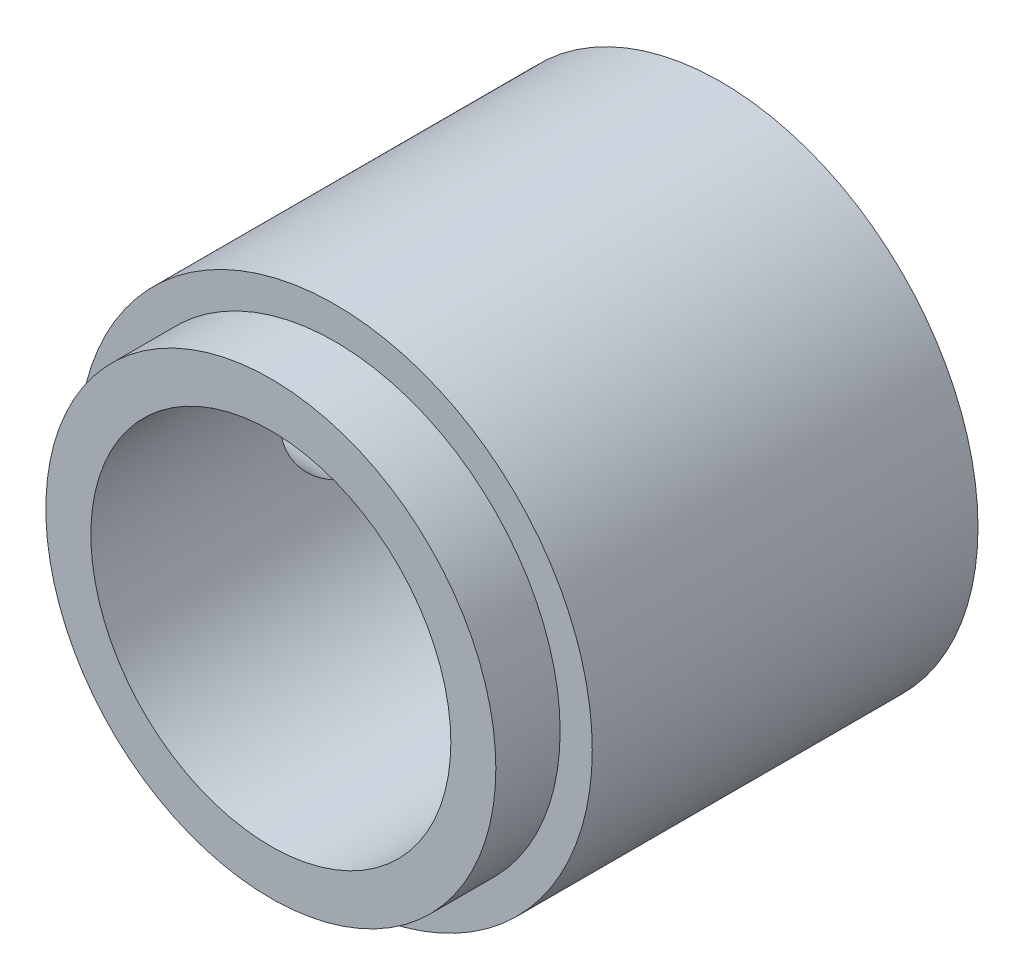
ISO-10303-21;
HEADER;
FILE_DESCRIPTION(('STEP AP214'),'2;1');
FILE_NAME('part.step','',(''),(''),'','','');
FILE_SCHEMA(('AUTOMOTIVE_DESIGN { 1 0 10303 214 1 1 1 1 }'));
ENDSEC;
DATA;
#1=APPLICATION_CONTEXT('core data for automotive mechanical design processes');
#2=APPLICATION_PROTOCOL_DEFINITION('international standard','automotive_design',2000,#1);
#3=PRODUCT_CONTEXT('',#1,'mechanical');
#4=PRODUCT('Part','Part','',(#3));
#5=PRODUCT_RELATED_PRODUCT_CATEGORY('part','',(#4));
#6=PRODUCT_DEFINITION_FORMATION('','',#4);
#7=PRODUCT_DEFINITION_CONTEXT('part definition',#1,'design');
#8=PRODUCT_DEFINITION('design','',#6,#7);
#9=PRODUCT_DEFINITION_SHAPE('','',#8);
#10=(LENGTH_UNIT() NAMED_UNIT(*) SI_UNIT(.MILLI.,.METRE.));
#11=(NAMED_UNIT(*) PLANE_ANGLE_UNIT() SI_UNIT($,.RADIAN.));
#12=(NAMED_UNIT(*) SI_UNIT($,.STERADIAN.) SOLID_ANGLE_UNIT());
#13=UNCERTAINTY_MEASURE_WITH_UNIT(LENGTH_MEASURE(1.E-05),#10,'distance_accuracy_value','');
#14=(GEOMETRIC_REPRESENTATION_CONTEXT(3) GLOBAL_UNCERTAINTY_ASSIGNED_CONTEXT((#13)) GLOBAL_UNIT_ASSIGNED_CONTEXT((#10,
#11,#12)) REPRESENTATION_CONTEXT('',''));
#15=CARTESIAN_POINT('',(0.,0.,0.));
#16=DIRECTION('',(0.,0.,1.));
#17=DIRECTION('',(1.,0.,0.));
#18=AXIS2_PLACEMENT_3D('',#15,#16,#17);
#19=CARTESIAN_POINT('',(0.,0.,30.));
#20=DIRECTION('',(0.,0.,1.));
#21=DIRECTION('',(1.,0.,0.));
#22=AXIS2_PLACEMENT_3D('',#19,#20,#21);
#23=PLANE('',#22);
#24=CARTESIAN_POINT('',(0.,0.,30.));
#25=DIRECTION('',(0.,0.,1.));
#26=DIRECTION('',(1.,0.,0.));
#27=AXIS2_PLACEMENT_3D('',#24,#25,#26);
#28=CIRCLE('',#27,20.);
#29=CARTESIAN_POINT('',(20.,0.,30.));
#30=VERTEX_POINT('',#29);
#31=EDGE_CURVE('E10',#30,#30,#28,.T.);
#32=ORIENTED_EDGE('',*,*,#31,.T.);
#33=EDGE_LOOP('',(#32));
#34=FACE_BOUND('',#33,.T.);
#35=CARTESIAN_POINT('',(0.,0.,30.));
#36=DIRECTION('',(0.,0.,1.));
#37=DIRECTION('',(1.,0.,0.));
#38=AXIS2_PLACEMENT_3D('',#35,#36,#37);
#39=CIRCLE('',#38,17.5);
#40=CARTESIAN_POINT('',(17.5,0.,30.));
#41=VERTEX_POINT('',#40);
#42=EDGE_CURVE('E52',#41,#41,#39,.T.);
#43=ORIENTED_EDGE('',*,*,#42,.F.);
#44=EDGE_LOOP('',(#43));
#45=FACE_BOUND('',#44,.T.);
#46=ADVANCED_FACE('F27',(#34,#45),#23,.T.);
#47=CARTESIAN_POINT('',(0.,0.,0.));
#48=DIRECTION('',(0.,0.,1.));
#49=DIRECTION('',(1.,0.,0.));
#50=AXIS2_PLACEMENT_3D('',#47,#48,#49);
#51=PLANE('',#50);
#52=CARTESIAN_POINT('',(0.,0.,0.));
#53=DIRECTION('',(0.,0.,1.));
#54=DIRECTION('',(1.,0.,0.));
#55=AXIS2_PLACEMENT_3D('',#52,#53,#54);
#56=CIRCLE('',#55,20.);
#57=CARTESIAN_POINT('',(20.,0.,0.));
#58=VERTEX_POINT('',#57);
#59=EDGE_CURVE('E40',#58,#58,#56,.T.);
#60=ORIENTED_EDGE('',*,*,#59,.F.);
#61=EDGE_LOOP('',(#60));
#62=FACE_BOUND('',#61,.T.);
#63=CARTESIAN_POINT('',(0.,0.,0.));
#64=DIRECTION('',(0.,0.,1.));
#65=DIRECTION('',(1.,0.,0.));
#66=AXIS2_PLACEMENT_3D('',#63,#64,#65);
#67=CIRCLE('',#66,14.);
#68=CARTESIAN_POINT('',(14.,0.,0.));
#69=VERTEX_POINT('',#68);
#70=EDGE_CURVE('E44',#69,#69,#67,.T.);
#71=ORIENTED_EDGE('',*,*,#70,.T.);
#72=EDGE_LOOP('',(#71));
#73=FACE_BOUND('',#72,.T.);
#74=ADVANCED_FACE('F80',(#62,#73),#51,.F.);
#75=CARTESIAN_POINT('',(0.,0.,30.));
#76=DIRECTION('',(0.,0.,-1.));
#77=DIRECTION('',(-1.,0.,0.));
#78=AXIS2_PLACEMENT_3D('',#75,#76,#77);
#79=CYLINDRICAL_SURFACE('',#78,20.);
#80=CARTESIAN_POINT('',(-20.,0.,20.25));
#81=CARTESIAN_POINT('',(-19.9999954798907,-0.289583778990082,20.2499927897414));
#82=CARTESIAN_POINT('',(-19.9936485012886,-0.579245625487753,20.2259599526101));
#83=CARTESIAN_POINT('',(-19.9689451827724,-1.15023585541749,20.1306270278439));
#84=CARTESIAN_POINT('',(-19.9505828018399,-1.4315599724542,20.0593031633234));
#85=CARTESIAN_POINT('',(-19.9038770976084,-1.97754931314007,19.8718586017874));
#86=CARTESIAN_POINT('',(-19.8755464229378,-2.24223514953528,19.7557946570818));
#87=CARTESIAN_POINT('',(-19.8119040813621,-2.74838329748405,19.4823722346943));
#88=CARTESIAN_POINT('',(-19.7765920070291,-2.98984425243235,19.3250113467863));
#89=CARTESIAN_POINT('',(-19.7019152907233,-3.44812793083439,18.9697187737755));
#90=CARTESIAN_POINT('',(-19.662483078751,-3.66435290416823,18.77103024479));
#91=CARTESIAN_POINT('',(-19.5844480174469,-4.06082667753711,18.340340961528));
#92=CARTESIAN_POINT('',(-19.5458452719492,-4.24107099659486,18.1083360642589));
#93=CARTESIAN_POINT('',(-19.473151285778,-4.56335504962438,17.6128617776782));
#94=CARTESIAN_POINT('',(-19.4391454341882,-4.70471198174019,17.3489345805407));
#95=CARTESIAN_POINT('',(-19.3804869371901,-4.94081250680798,16.8000240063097));
#96=CARTESIAN_POINT('',(-19.3558326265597,-5.03556439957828,16.5150443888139));
#97=CARTESIAN_POINT('',(-19.3193654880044,-5.1736986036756,15.9387266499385));
#98=CARTESIAN_POINT('',(-19.3072827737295,-5.21816240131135,15.6476652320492));
#99=CARTESIAN_POINT('',(-19.2965201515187,-5.25782918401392,15.0619827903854));
#100=CARTESIAN_POINT('',(-19.2978378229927,-5.25304106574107,14.7673624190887));
#101=CARTESIAN_POINT('',(-19.3134852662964,-5.19519961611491,14.1913271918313));
#102=CARTESIAN_POINT('',(-19.3274636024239,-5.14344977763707,13.9097703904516));
#103=CARTESIAN_POINT('',(-19.3662953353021,-4.99523945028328,13.3594823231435));
#104=CARTESIAN_POINT('',(-19.3911495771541,-4.89877548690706,13.0907520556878));
#105=CARTESIAN_POINT('',(-19.4492451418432,-4.66280064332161,12.570322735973));
#106=CARTESIAN_POINT('',(-19.482575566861,-4.52282869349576,12.3188431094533));
#107=CARTESIAN_POINT('',(-19.5538194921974,-4.20413302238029,11.8424807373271));
#108=CARTESIAN_POINT('',(-19.5917338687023,-4.02540188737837,11.617603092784));
#109=CARTESIAN_POINT('',(-19.6693408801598,-3.62757423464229,11.1933749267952));
#110=CARTESIAN_POINT('',(-19.7090518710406,-3.40738171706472,10.9950541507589));
#111=CARTESIAN_POINT('',(-19.7847030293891,-2.93638087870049,10.6379466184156));
#112=CARTESIAN_POINT('',(-19.8206430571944,-2.68557142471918,10.4791613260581));
#113=CARTESIAN_POINT('',(-19.8849126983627,-2.15889372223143,10.2051981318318));
#114=CARTESIAN_POINT('',(-19.9132105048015,-1.88292694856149,10.0902016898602));
#115=CARTESIAN_POINT('',(-19.9587770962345,-1.31466664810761,9.90852863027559));
#116=CARTESIAN_POINT('',(-19.9760482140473,-1.02237658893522,9.84184179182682));
#117=CARTESIAN_POINT('',(-19.9972645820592,-0.438558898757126,9.76028644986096));
#118=CARTESIAN_POINT('',(-20.0015699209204,-0.147239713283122,9.74401735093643));
#119=CARTESIAN_POINT('',(-19.9974024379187,0.433962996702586,9.75989815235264));
#120=CARTESIAN_POINT('',(-19.9889308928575,0.723846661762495,9.79204321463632));
#121=CARTESIAN_POINT('',(-19.9603936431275,1.28898438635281,9.90268952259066));
#122=CARTESIAN_POINT('',(-19.9405223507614,1.56440125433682,9.98041393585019));
#123=CARTESIAN_POINT('',(-19.8914357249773,2.09826387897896,10.1791143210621));
#124=CARTESIAN_POINT('',(-19.8622193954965,2.35670782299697,10.3000949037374));
#125=CARTESIAN_POINT('',(-19.7968348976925,2.85476391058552,10.5845009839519));
#126=CARTESIAN_POINT('',(-19.7605444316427,3.09392121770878,10.7486941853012));
#127=CARTESIAN_POINT('',(-19.6852087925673,3.54178165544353,11.1138954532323));
#128=CARTESIAN_POINT('',(-19.6461630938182,3.75047895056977,11.3149105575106));
#129=CARTESIAN_POINT('',(-19.5684000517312,4.13736419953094,11.7545778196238));
#130=CARTESIAN_POINT('',(-19.5297206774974,4.31456533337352,11.994106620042));
#131=CARTESIAN_POINT('',(-19.458244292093,4.62627285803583,12.5003132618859));
#132=CARTESIAN_POINT('',(-19.4254470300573,4.76078106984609,12.7669899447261));
#133=CARTESIAN_POINT('',(-19.3698222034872,4.98227207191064,13.3185600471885));
#134=CARTESIAN_POINT('',(-19.3469365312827,5.06953263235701,13.6033357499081));
#135=CARTESIAN_POINT('',(-19.3137013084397,5.19472972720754,14.1842180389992));
#136=CARTESIAN_POINT('',(-19.3033486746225,5.23267839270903,14.4803218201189));
#137=CARTESIAN_POINT('',(-19.2966035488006,5.25749271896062,15.0653679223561));
#138=CARTESIAN_POINT('',(-19.2997782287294,5.2459421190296,15.3542391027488));
#139=CARTESIAN_POINT('',(-19.3187198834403,5.17574697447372,15.9257595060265));
#140=CARTESIAN_POINT('',(-19.3344865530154,5.11710357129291,16.2084088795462));
#141=CARTESIAN_POINT('',(-19.3765821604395,4.95529239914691,16.7575384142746));
#142=CARTESIAN_POINT('',(-19.402833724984,4.85245038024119,17.0241209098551));
#143=CARTESIAN_POINT('',(-19.4629452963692,4.6054151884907,17.5364469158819));
#144=CARTESIAN_POINT('',(-19.4968064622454,4.46121571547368,17.7821872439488));
#145=CARTESIAN_POINT('',(-19.5695308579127,4.13071692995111,18.2534369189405));
#146=CARTESIAN_POINT('',(-19.6085093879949,3.94333219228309,18.4781673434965));
#147=CARTESIAN_POINT('',(-19.6864216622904,3.53385937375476,18.8935086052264));
#148=CARTESIAN_POINT('',(-19.7253553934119,3.31176292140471,19.0841111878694));
#149=CARTESIAN_POINT('',(-19.7997468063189,2.83366767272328,19.429625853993));
#150=CARTESIAN_POINT('',(-19.8351166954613,2.57706637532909,19.5837247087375));
#151=CARTESIAN_POINT('',(-19.8974440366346,2.0406839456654,19.8463538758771));
#152=CARTESIAN_POINT('',(-19.924407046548,1.76091828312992,19.9549143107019));
#153=CARTESIAN_POINT('',(-19.9632672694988,1.23504055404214,20.1087220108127));
#154=CARTESIAN_POINT('',(-19.9769431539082,0.9912585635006,20.1615804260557));
#155=CARTESIAN_POINT('',(-19.9953110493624,0.498336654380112,20.2322209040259));
#156=CARTESIAN_POINT('',(-20.0000038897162,0.249197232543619,20.2500062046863));
#157=CARTESIAN_POINT('',(-20.,0.,20.25));
#158=B_SPLINE_CURVE_WITH_KNOTS('',3,(#80,#81,#82,#83,#84,#85,#86,#87,#88,#89,#90,#91,#92,#93,
#94,#95,#96,#97,#98,#99,#100,#101,#102,#103,#104,#105,#106,#107,#108,#109,#110,#111,#112,#113,
#114,#115,#116,#117,#118,#119,#120,#121,#122,#123,#124,#125,#126,#127,#128,#129,#130,#131,#132,
#133,#134,#135,#136,#137,#138,#139,#140,#141,#142,#143,#144,#145,#146,#147,#148,#149,#150,#151,
#152,#153,#154,#155,#156,#157),.UNSPECIFIED.,.T.,.F.,(4,2,2,2,2,2,2,2,2,2,2,2,2,2,2,2,2,2,2,2,2,
2,2,2,2,2,2,2,2,2,2,2,2,2,2,2,2,2,4),(0.,0.867837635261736,1.73611193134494,2.60328843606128,
3.47051556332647,4.35529929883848,5.24019315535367,6.13975497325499,7.03915653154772,
7.91882430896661,8.79833318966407,9.65415257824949,10.5100384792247,11.3753229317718,
12.2407730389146,13.1335394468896,14.0263389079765,14.9227988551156,15.8190690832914,
16.6902071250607,17.5612581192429,18.4178779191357,19.274589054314,20.1476892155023,
21.0209564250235,21.9180299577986,22.8150652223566,23.7067678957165,24.5982511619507,
25.4614278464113,26.3245836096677,27.1814840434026,28.0385150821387,28.9200399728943,
29.8017777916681,30.7016210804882,31.6008682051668,32.3477425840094,33.094548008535),.UNSPECIFIED.);
#159=CARTESIAN_POINT('',(-20.,0.,20.25));
#160=VERTEX_POINT('',#159);
#161=EDGE_CURVE('E58',#160,#160,#158,.T.);
#162=ORIENTED_EDGE('',*,*,#161,.T.);
#163=EDGE_LOOP('',(#162));
#164=FACE_BOUND('',#163,.T.);
#165=ORIENTED_EDGE('',*,*,#31,.F.);
#166=EDGE_LOOP('',(#165));
#167=FACE_BOUND('',#166,.T.);
#168=ORIENTED_EDGE('',*,*,#59,.T.);
#169=EDGE_LOOP('',(#168));
#170=FACE_BOUND('',#169,.T.);
#171=ADVANCED_FACE('F29',(#164,#167,#170),#79,.T.);
#172=CARTESIAN_POINT('',(0.,0.,30.));
#173=DIRECTION('',(0.,0.,-1.));
#174=DIRECTION('',(-1.,0.,0.));
#175=AXIS2_PLACEMENT_3D('',#172,#173,#174);
#176=CYLINDRICAL_SURFACE('',#175,14.);
#177=CARTESIAN_POINT('',(-14.,0.,20.25));
#178=CARTESIAN_POINT('',(-14.000000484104,-0.142125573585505,20.2500006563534));
#179=CARTESIAN_POINT('',(-13.9978310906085,-0.284242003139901,20.2442242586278));
#180=CARTESIAN_POINT('',(-13.9892124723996,-0.567457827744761,20.2211762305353));
#181=CARTESIAN_POINT('',(-13.9827618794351,-0.708556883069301,20.2039009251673));
#182=CARTESIAN_POINT('',(-13.965757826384,-0.988571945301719,20.1580368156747));
#183=CARTESIAN_POINT('',(-13.9552065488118,-1.12748907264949,20.1294540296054));
#184=CARTESIAN_POINT('',(-13.9302779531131,-1.40228445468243,20.0612400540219));
#185=CARTESIAN_POINT('',(-13.9158991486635,-1.53816150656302,20.0216045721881));
#186=CARTESIAN_POINT('',(-13.8837281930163,-1.80559682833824,19.931750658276));
#187=CARTESIAN_POINT('',(-13.8659441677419,-1.93716452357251,19.8815573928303));
#188=CARTESIAN_POINT('',(-13.8273959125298,-2.1954998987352,19.7709596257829));
#189=CARTESIAN_POINT('',(-13.8066305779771,-2.32226577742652,19.7105513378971));
#190=CARTESIAN_POINT('',(-13.7406229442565,-2.69415159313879,19.5146868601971));
#191=CARTESIAN_POINT('',(-13.6916429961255,-2.93106603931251,19.3645212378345));
#192=CARTESIAN_POINT('',(-13.5865158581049,-3.38574807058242,19.022849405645));
#193=CARTESIAN_POINT('',(-13.5301660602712,-3.60243534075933,18.8299805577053));
#194=CARTESIAN_POINT('',(-13.4176017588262,-4.00136697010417,18.4110269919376));
#195=CARTESIAN_POINT('',(-13.3613873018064,-4.1836007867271,18.1849321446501));
#196=CARTESIAN_POINT('',(-13.2807314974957,-4.43058557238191,17.820485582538));
#197=CARTESIAN_POINT('',(-13.2539989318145,-4.50972075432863,17.6921563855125));
#198=CARTESIAN_POINT('',(-13.2030271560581,-4.65683642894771,17.4288034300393));
#199=CARTESIAN_POINT('',(-13.1787869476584,-4.72482139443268,17.2937823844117));
#200=CARTESIAN_POINT('',(-13.1335801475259,-4.84906694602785,17.017906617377));
#201=CARTESIAN_POINT('',(-13.1126139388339,-4.90532616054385,16.8770512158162));
#202=CARTESIAN_POINT('',(-13.0746814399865,-5.00555476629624,16.5905761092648));
#203=CARTESIAN_POINT('',(-13.057713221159,-5.04953008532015,16.4449587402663));
#204=CARTESIAN_POINT('',(-13.0289690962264,-5.12322805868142,16.1560083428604));
#205=CARTESIAN_POINT('',(-13.0170103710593,-5.15345683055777,16.0128225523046));
#206=CARTESIAN_POINT('',(-12.9977387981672,-5.20187154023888,15.7241789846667));
#207=CARTESIAN_POINT('',(-12.9904239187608,-5.22006274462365,15.5787222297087));
#208=CARTESIAN_POINT('',(-12.9806922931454,-5.24421566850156,15.2866547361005));
#209=CARTESIAN_POINT('',(-12.9782748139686,-5.250179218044,15.1400441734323));
#210=CARTESIAN_POINT('',(-12.9784232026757,-5.24981259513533,14.8468438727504));
#211=CARTESIAN_POINT('',(-12.9809888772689,-5.24348289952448,14.7002541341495));
#212=CARTESIAN_POINT('',(-12.9907079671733,-5.21935439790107,14.4170722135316));
#213=CARTESIAN_POINT('',(-12.9975763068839,-5.20226796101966,14.2804087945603));
#214=CARTESIAN_POINT('',(-13.0154187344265,-5.1574660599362,14.0090617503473));
#215=CARTESIAN_POINT('',(-13.0263941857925,-5.12974706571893,13.8743787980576));
#216=CARTESIAN_POINT('',(-13.0521128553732,-5.06395052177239,13.6079775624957));
#217=CARTESIAN_POINT('',(-13.066855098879,-5.0258756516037,13.4762585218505));
#218=CARTESIAN_POINT('',(-13.0996821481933,-4.93968145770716,13.2165264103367));
#219=CARTESIAN_POINT('',(-13.1177682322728,-4.89155829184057,13.0885147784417));
#220=CARTESIAN_POINT('',(-13.157132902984,-4.78467916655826,12.8346684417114));
#221=CARTESIAN_POINT('',(-13.1784644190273,-4.7257427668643,12.7089179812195));
#222=CARTESIAN_POINT('',(-13.2234793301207,-4.59827816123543,12.4627661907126));
#223=CARTESIAN_POINT('',(-13.2471635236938,-4.529746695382,12.3423666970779));
#224=CARTESIAN_POINT('',(-13.2962527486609,-4.38356091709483,12.1075929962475));
#225=CARTESIAN_POINT('',(-13.3216579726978,-4.30590558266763,11.9932194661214));
#226=CARTESIAN_POINT('',(-13.3735420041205,-4.14195202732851,11.7711007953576));
#227=CARTESIAN_POINT('',(-13.4000208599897,-4.0556534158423,11.6633559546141));
#228=CARTESIAN_POINT('',(-13.4552034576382,-3.86880030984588,11.4480215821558));
#229=CARTESIAN_POINT('',(-13.4839368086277,-3.76767688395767,11.3409326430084));
#230=CARTESIAN_POINT('',(-13.5410937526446,-3.55678372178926,11.1356188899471));
#231=CARTESIAN_POINT('',(-13.5695174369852,-3.44701661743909,11.0373913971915));
#232=CARTESIAN_POINT('',(-13.6253164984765,-3.2193922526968,10.8503343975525));
#233=CARTESIAN_POINT('',(-13.6526913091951,-3.10153071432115,10.7615099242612));
#234=CARTESIAN_POINT('',(-13.7056314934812,-2.85851739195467,10.5939642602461));
#235=CARTESIAN_POINT('',(-13.7311975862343,-2.73336854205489,10.5152390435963));
#236=CARTESIAN_POINT('',(-13.7802293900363,-2.47445153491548,10.3672714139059));
#237=CARTESIAN_POINT('',(-13.8036550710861,-2.34057769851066,10.2982003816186));
#238=CARTESIAN_POINT('',(-13.8472625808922,-2.06700134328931,10.1716764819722));
#239=CARTESIAN_POINT('',(-13.867445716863,-1.92730120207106,10.114218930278));
#240=CARTESIAN_POINT('',(-13.903990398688,-1.64303997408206,10.0114373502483));
#241=CARTESIAN_POINT('',(-13.9203525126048,-1.49847961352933,9.96611151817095));
#242=CARTESIAN_POINT('',(-13.9487707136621,-1.20558595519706,9.88805044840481));
#243=CARTESIAN_POINT('',(-13.960827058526,-1.05725288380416,9.85531445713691));
#244=CARTESIAN_POINT('',(-13.9797493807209,-0.766000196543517,9.80419166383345));
#245=CARTESIAN_POINT('',(-13.9868579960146,-0.623214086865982,9.78513237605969));
#246=CARTESIAN_POINT('',(-13.9966947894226,-0.336355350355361,9.75880591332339));
#247=CARTESIAN_POINT('',(-13.9994214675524,-0.192282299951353,9.75154277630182));
#248=CARTESIAN_POINT('',(-14.0004126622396,0.0959043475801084,9.7488995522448));
#249=CARTESIAN_POINT('',(-13.998679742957,0.240017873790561,9.75351263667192));
#250=CARTESIAN_POINT('',(-13.990804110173,0.527311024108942,9.77456268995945));
#251=CARTESIAN_POINT('',(-13.9846597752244,0.670490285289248,9.79100400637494));
#252=CARTESIAN_POINT('',(-13.9684527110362,0.949241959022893,9.83467681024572));
#253=CARTESIAN_POINT('',(-13.9585515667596,1.08489372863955,9.86146406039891));
#254=CARTESIAN_POINT('',(-13.9350798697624,1.35341004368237,9.92556992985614));
#255=CARTESIAN_POINT('',(-13.9215080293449,1.48627359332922,9.96289224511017));
#256=CARTESIAN_POINT('',(-13.8910384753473,1.74826763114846,10.0477262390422));
#257=CARTESIAN_POINT('',(-13.8741417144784,1.87739917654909,10.09523499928));
#258=CARTESIAN_POINT('',(-13.8374240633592,2.13123177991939,10.2000817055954));
#259=CARTESIAN_POINT('',(-13.8176020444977,2.25593110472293,10.2574234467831));
#260=CARTESIAN_POINT('',(-13.7748994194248,2.50367769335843,10.3832956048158));
#261=CARTESIAN_POINT('',(-13.7519467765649,2.62657213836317,10.4521023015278));
#262=CARTESIAN_POINT('',(-13.7040089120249,2.86619558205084,10.5991825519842));
#263=CARTESIAN_POINT('',(-13.6790229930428,2.98292244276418,10.6774593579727));
#264=CARTESIAN_POINT('',(-13.6276307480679,3.20954568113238,10.8429570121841));
#265=CARTESIAN_POINT('',(-13.6012242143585,3.31944105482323,10.9301791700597));
#266=CARTESIAN_POINT('',(-13.5476342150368,3.53179868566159,11.1130303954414));
#267=CARTESIAN_POINT('',(-13.5204507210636,3.63426067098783,11.2086597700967));
#268=CARTESIAN_POINT('',(-13.4643813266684,3.83694236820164,11.4135904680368));
#269=CARTESIAN_POINT('',(-13.4354885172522,3.93668360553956,11.5233637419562));
#270=CARTESIAN_POINT('',(-13.3783869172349,4.1265715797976,11.7510198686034));
#271=CARTESIAN_POINT('',(-13.3501779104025,4.21672138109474,11.8689001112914));
#272=CARTESIAN_POINT('',(-13.2952261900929,4.38690810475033,12.1121664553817));
#273=CARTESIAN_POINT('',(-13.268484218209,4.46693993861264,12.237556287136));
#274=CARTESIAN_POINT('',(-13.2172895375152,4.616219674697,12.4949764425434));
#275=CARTESIAN_POINT('',(-13.1928358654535,4.68547212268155,12.62700393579));
#276=CARTESIAN_POINT('',(-13.1468621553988,4.81296502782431,12.8975416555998));
#277=CARTESIAN_POINT('',(-13.1253562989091,4.87115273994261,13.0360791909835));
#278=CARTESIAN_POINT('',(-13.0861363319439,4.97555503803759,13.3180538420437));
#279=CARTESIAN_POINT('',(-13.0684206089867,5.02177471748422,13.4614888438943));
#280=CARTESIAN_POINT('',(-13.0373925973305,5.10178774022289,13.7522083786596));
#281=CARTESIAN_POINT('',(-13.0240789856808,5.1355848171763,13.8994917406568));
#282=CARTESIAN_POINT('',(-13.0023347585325,5.19039153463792,14.1967718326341));
#283=CARTESIAN_POINT('',(-12.9939038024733,5.21140206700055,14.3467683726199));
#284=CARTESIAN_POINT('',(-12.9826163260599,5.2394545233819,14.638494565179));
#285=CARTESIAN_POINT('',(-12.9794355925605,5.24730935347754,14.7801340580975));
#286=CARTESIAN_POINT('',(-12.9777291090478,5.25152870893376,15.0636630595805));
#287=CARTESIAN_POINT('',(-12.9792049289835,5.24788935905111,15.205552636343));
#288=CARTESIAN_POINT('',(-12.9867640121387,5.22915492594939,15.4883803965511));
#289=CARTESIAN_POINT('',(-12.9928451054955,5.21406523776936,15.6293189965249));
#290=CARTESIAN_POINT('',(-13.0094121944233,5.17259039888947,15.9093117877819));
#291=CARTESIAN_POINT('',(-13.0198998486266,5.14620099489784,16.0483652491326));
#292=CARTESIAN_POINT('',(-13.0445534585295,5.08337744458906,16.3192800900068));
#293=CARTESIAN_POINT('',(-13.0585954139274,5.04727976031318,16.4512308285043));
#294=CARTESIAN_POINT('',(-13.0900810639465,4.96504856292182,16.7115656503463));
#295=CARTESIAN_POINT('',(-13.1075259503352,4.91891153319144,16.8399484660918));
#296=CARTESIAN_POINT('',(-13.1642436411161,4.76598063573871,17.218528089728));
#297=CARTESIAN_POINT('',(-13.2079190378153,4.64461962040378,17.4623582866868));
#298=CARTESIAN_POINT('',(-13.3048916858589,4.35931953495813,17.939428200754));
#299=CARTESIAN_POINT('',(-13.3585732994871,4.19348201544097,18.1714427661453));
#300=CARTESIAN_POINT('',(-13.4682247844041,3.82667412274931,18.6055104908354));
#301=CARTESIAN_POINT('',(-13.5241953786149,3.62569258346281,18.8075540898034));
#302=CARTESIAN_POINT('',(-13.6070742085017,3.29566411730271,19.08945352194));
#303=CARTESIAN_POINT('',(-13.6352217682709,3.17748289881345,19.1819446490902));
#304=CARTESIAN_POINT('',(-13.6898081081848,2.93338792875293,19.3566300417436));
#305=CARTESIAN_POINT('',(-13.716247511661,2.80747703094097,19.4388280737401));
#306=CARTESIAN_POINT('',(-13.7666936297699,2.54863594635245,19.5923431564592));
#307=CARTESIAN_POINT('',(-13.7906990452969,2.41570206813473,19.663654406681));
#308=CARTESIAN_POINT('',(-13.8355718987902,2.14381037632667,19.7947199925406));
#309=CARTESIAN_POINT('',(-13.8564406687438,2.00485515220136,19.8544792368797));
#310=CARTESIAN_POINT('',(-13.8952808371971,1.71562763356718,19.9642809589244));
#311=CARTESIAN_POINT('',(-13.9130846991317,1.56512633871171,20.0137813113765));
#312=CARTESIAN_POINT('',(-13.9440387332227,1.25988234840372,20.0990484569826));
#313=CARTESIAN_POINT('',(-13.9571909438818,1.1051415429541,20.1348212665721));
#314=CARTESIAN_POINT('',(-13.9784143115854,0.792741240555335,20.192232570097));
#315=CARTESIAN_POINT('',(-13.9864863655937,0.635082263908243,20.2138735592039));
#316=CARTESIAN_POINT('',(-13.9972786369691,0.318278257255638,20.2427560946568));
#317=CARTESIAN_POINT('',(-13.9999994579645,0.15913339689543,20.2499992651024));
#318=CARTESIAN_POINT('',(-14.,0.,20.25));
#319=B_SPLINE_CURVE_WITH_KNOTS('',3,(#177,#178,#179,#180,#181,#182,#183,#184,#185,#186,#187,
#188,#189,#190,#191,#192,#193,#194,#195,#196,#197,#198,#199,#200,#201,#202,#203,#204,#205,#206,
#207,#208,#209,#210,#211,#212,#213,#214,#215,#216,#217,#218,#219,#220,#221,#222,#223,#224,#225,
#226,#227,#228,#229,#230,#231,#232,#233,#234,#235,#236,#237,#238,#239,#240,#241,#242,#243,#244,
#245,#246,#247,#248,#249,#250,#251,#252,#253,#254,#255,#256,#257,#258,#259,#260,#261,#262,#263,
#264,#265,#266,#267,#268,#269,#270,#271,#272,#273,#274,#275,#276,#277,#278,#279,#280,#281,#282,
#283,#284,#285,#286,#287,#288,#289,#290,#291,#292,#293,#294,#295,#296,#297,#298,#299,#300,#301,
#302,#303,#304,#305,#306,#307,#308,#309,#310,#311,#312,#313,#314,#315,#316,#317,#318),
.UNSPECIFIED.,.T.,.F.,(4,2,2,2,2,2,2,2,2,2,2,2,2,2,2,2,2,2,2,2,2,2,2,2,2,2,2,2,2,2,2,2,2,2,2,2,
2,2,2,2,2,2,2,2,2,2,2,2,2,2,2,2,2,2,2,2,2,2,2,2,2,2,2,2,2,2,2,2,2,2,4),(0.,0.426227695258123,
0.852591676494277,1.27872904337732,1.70503213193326,2.13033032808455,2.55578651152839,
3.4060485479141,4.28886336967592,5.17194789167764,5.63083128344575,6.08953014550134,
6.54828263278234,7.00681335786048,7.44673003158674,7.88645410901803,8.32611237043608,
8.76575357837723,9.17896470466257,9.592313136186,10.0055547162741,10.4189545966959,
10.8400118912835,11.261212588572,11.6824605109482,12.1037274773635,12.5534069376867,
13.0029499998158,13.4527325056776,13.9023351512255,14.3591127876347,14.815705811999,
15.2722309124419,15.7287286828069,16.1608668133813,16.5931528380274,17.02519036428,
17.4573867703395,17.8727843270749,18.2883277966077,18.7037523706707,19.119337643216,
19.546976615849,19.9747628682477,20.4026118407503,20.8304764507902,21.2832702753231,
21.7359189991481,22.1887944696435,22.641478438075,23.0962690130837,23.5508657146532,
24.005325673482,24.4597539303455,24.884898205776,25.3101858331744,25.7352732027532,
26.1605207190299,26.5725959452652,26.9848157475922,27.8086367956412,28.675642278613,
29.5429237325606,30.0005291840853,30.4579666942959,30.9156470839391,31.3731325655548,
31.850713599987,32.3280850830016,32.80537225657,33.2826055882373),.UNSPECIFIED.);
#320=CARTESIAN_POINT('',(-14.,0.,20.25));
#321=VERTEX_POINT('',#320);
#322=EDGE_CURVE('E32',#321,#321,#319,.T.);
#323=ORIENTED_EDGE('',*,*,#322,.F.);
#324=EDGE_LOOP('',(#323));
#325=FACE_BOUND('',#324,.T.);
#326=ORIENTED_EDGE('',*,*,#70,.F.);
#327=EDGE_LOOP('',(#326));
#328=FACE_BOUND('',#327,.T.);
#329=CARTESIAN_POINT('',(0.,0.,35.));
#330=DIRECTION('',(0.,0.,1.));
#331=DIRECTION('',(1.,0.,0.));
#332=AXIS2_PLACEMENT_3D('',#329,#330,#331);
#333=CIRCLE('',#332,14.);
#334=CARTESIAN_POINT('',(14.,0.,35.));
#335=VERTEX_POINT('',#334);
#336=EDGE_CURVE('E55',#335,#335,#333,.T.);
#337=ORIENTED_EDGE('',*,*,#336,.T.);
#338=EDGE_LOOP('',(#337));
#339=FACE_BOUND('',#338,.T.);
#340=ADVANCED_FACE('F72',(#325,#328,#339),#176,.F.);
#341=CARTESIAN_POINT('',(0.,0.,35.));
#342=DIRECTION('',(0.,0.,1.));
#343=DIRECTION('',(1.,0.,0.));
#344=AXIS2_PLACEMENT_3D('',#341,#342,#343);
#345=PLANE('',#344);
#346=CARTESIAN_POINT('',(0.,0.,35.));
#347=DIRECTION('',(0.,0.,1.));
#348=DIRECTION('',(1.,0.,0.));
#349=AXIS2_PLACEMENT_3D('',#346,#347,#348);
#350=CIRCLE('',#349,17.5);
#351=CARTESIAN_POINT('',(17.5,0.,35.));
#352=VERTEX_POINT('',#351);
#353=EDGE_CURVE('E49',#352,#352,#350,.T.);
#354=ORIENTED_EDGE('',*,*,#353,.T.);
#355=EDGE_LOOP('',(#354));
#356=FACE_BOUND('',#355,.T.);
#357=ORIENTED_EDGE('',*,*,#336,.F.);
#358=EDGE_LOOP('',(#357));
#359=FACE_BOUND('',#358,.T.);
#360=ADVANCED_FACE('F68',(#356,#359),#345,.T.);
#361=CARTESIAN_POINT('',(0.,0.,35.));
#362=DIRECTION('',(0.,0.,-1.));
#363=DIRECTION('',(-1.,0.,0.));
#364=AXIS2_PLACEMENT_3D('',#361,#362,#363);
#365=CYLINDRICAL_SURFACE('',#364,17.5);
#366=ORIENTED_EDGE('',*,*,#353,.F.);
#367=EDGE_LOOP('',(#366));
#368=FACE_BOUND('',#367,.T.);
#369=ORIENTED_EDGE('',*,*,#42,.T.);
#370=EDGE_LOOP('',(#369));
#371=FACE_BOUND('',#370,.T.);
#372=ADVANCED_FACE('F66',(#368,#371),#365,.T.);
#373=CARTESIAN_POINT('',(-25.,0.,15.));
#374=DIRECTION('',(1.,0.,0.));
#375=DIRECTION('',(0.,0.,-1.));
#376=AXIS2_PLACEMENT_3D('',#373,#374,#375);
#377=CYLINDRICAL_SURFACE('',#376,5.25);
#378=ORIENTED_EDGE('',*,*,#322,.T.);
#379=EDGE_LOOP('',(#378));
#380=FACE_BOUND('',#379,.T.);
#381=ORIENTED_EDGE('',*,*,#161,.F.);
#382=EDGE_LOOP('',(#381));
#383=FACE_BOUND('',#382,.T.);
#384=ADVANCED_FACE('F62',(#380,#383),#377,.F.);
#385=CLOSED_SHELL('',(#46,#74,#171,#340,#360,#372,#384));
#386=MANIFOLD_SOLID_BREP('B2',#385);
#387=ADVANCED_BREP_SHAPE_REPRESENTATION('',(#18,#386),#14);
#388=SHAPE_DEFINITION_REPRESENTATION(#9,#387);
ENDSEC;
END-ISO-10303-21;
